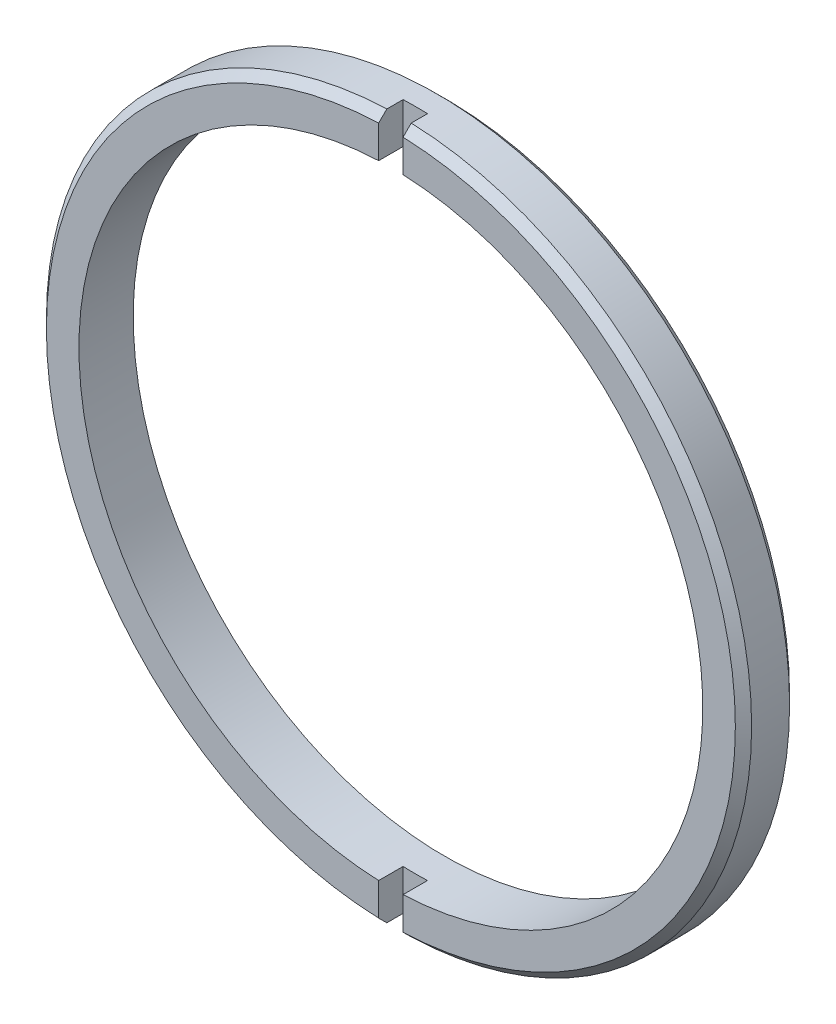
from build123d import *

# Parameters (mm, degrees)
SKETCH_1_R               = 13
SKETCH_1_R_2             = 11.5
EXTRUDE_1_DEPTH          = 2
CUT_EXTRUDE_1_DEPTH      = 19.493242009
CUT_EXTRUDE_1_DEPTH_BACK = 19.493242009
SKETCH_2_W               = 0.9
SKETCH_2_H               = 0.9
CHAMFER_1_SIZE           = 0.3


with BuildPart() as part:
    # Sketch 1 → Extrude 1 (new body)
    with BuildSketch(Plane.XY):
        Circle(SKETCH_1_R)
        Circle(SKETCH_1_R_2, mode=Mode.SUBTRACT)
    extrude(amount=EXTRUDE_1_DEPTH)

    # Sketch 2 → Cut-Extrude 1 (cut, two sides: drawn at the far end of the back side and taken through both)
    with BuildSketch(Plane(origin=(0, 0, 0), x_dir=(1, 0, 0), z_dir=(0, 1, 0)).offset(-CUT_EXTRUDE_1_DEPTH_BACK)):
        with Locations((0, -1.55)):
            Rectangle(SKETCH_2_W, SKETCH_2_H)
    extrude(amount=CUT_EXTRUDE_1_DEPTH + CUT_EXTRUDE_1_DEPTH_BACK, mode=Mode.SUBTRACT)

    # Chamfer 1
    chamfer_1_edges = [part.edges().sort_by_distance(p)[0] for p in [
        (-13, 0, 2),
        (9.350133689, -9.031887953, 2),
        (-13, 0, 0),
    ]]
    chamfer(chamfer_1_edges, length=CHAMFER_1_SIZE)


solid = part.part
